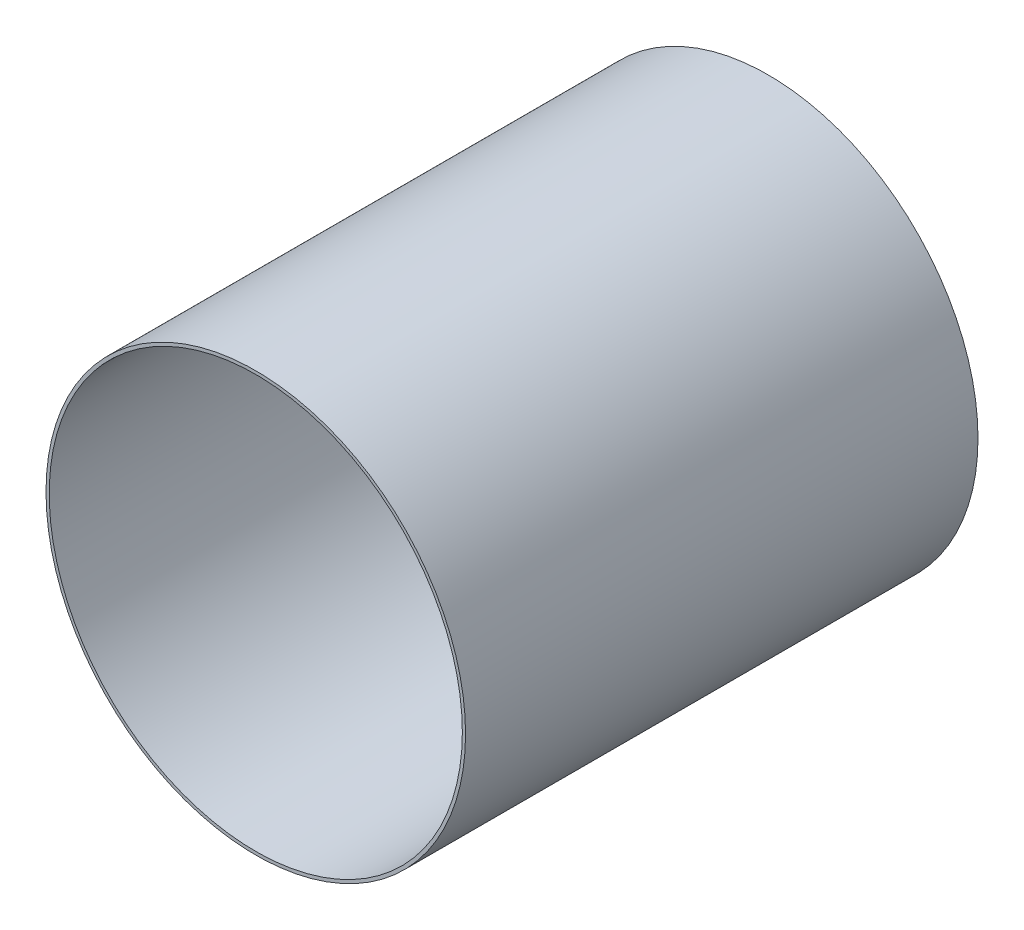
ISO-10303-21;
HEADER;
FILE_DESCRIPTION(('STEP AP214'),'2;1');
FILE_NAME('part.step','',(''),(''),'','','');
FILE_SCHEMA(('AUTOMOTIVE_DESIGN { 1 0 10303 214 1 1 1 1 }'));
ENDSEC;
DATA;
#1=APPLICATION_CONTEXT('core data for automotive mechanical design processes');
#2=APPLICATION_PROTOCOL_DEFINITION('international standard','automotive_design',2000,#1);
#3=PRODUCT_CONTEXT('',#1,'mechanical');
#4=PRODUCT('Part','Part','',(#3));
#5=PRODUCT_RELATED_PRODUCT_CATEGORY('part','',(#4));
#6=PRODUCT_DEFINITION_FORMATION('','',#4);
#7=PRODUCT_DEFINITION_CONTEXT('part definition',#1,'design');
#8=PRODUCT_DEFINITION('design','',#6,#7);
#9=PRODUCT_DEFINITION_SHAPE('','',#8);
#10=(LENGTH_UNIT() NAMED_UNIT(*) SI_UNIT(.MILLI.,.METRE.));
#11=(NAMED_UNIT(*) PLANE_ANGLE_UNIT() SI_UNIT($,.RADIAN.));
#12=(NAMED_UNIT(*) SI_UNIT($,.STERADIAN.) SOLID_ANGLE_UNIT());
#13=UNCERTAINTY_MEASURE_WITH_UNIT(LENGTH_MEASURE(1.E-05),#10,'distance_accuracy_value','');
#14=(GEOMETRIC_REPRESENTATION_CONTEXT(3) GLOBAL_UNCERTAINTY_ASSIGNED_CONTEXT((#13)) GLOBAL_UNIT_ASSIGNED_CONTEXT((#10,
#11,#12)) REPRESENTATION_CONTEXT('',''));
#15=CARTESIAN_POINT('',(0.,0.,0.));
#16=DIRECTION('',(0.,0.,1.));
#17=DIRECTION('',(1.,0.,0.));
#18=AXIS2_PLACEMENT_3D('',#15,#16,#17);
#19=CARTESIAN_POINT('',(0.,0.,31.));
#20=DIRECTION('',(0.,0.,1.));
#21=DIRECTION('',(1.,0.,0.));
#22=AXIS2_PLACEMENT_3D('',#19,#20,#21);
#23=PLANE('',#22);
#24=CARTESIAN_POINT('',(0.,0.,31.));
#25=DIRECTION('',(0.,0.,1.));
#26=DIRECTION('',(1.,0.,0.));
#27=AXIS2_PLACEMENT_3D('',#24,#25,#26);
#28=CIRCLE('',#27,13.1);
#29=CARTESIAN_POINT('',(13.1,0.,31.));
#30=VERTEX_POINT('',#29);
#31=EDGE_CURVE('E10',#30,#30,#28,.T.);
#32=ORIENTED_EDGE('',*,*,#31,.T.);
#33=EDGE_LOOP('',(#32));
#34=FACE_BOUND('',#33,.T.);
#35=CARTESIAN_POINT('',(0.,0.,31.));
#36=DIRECTION('',(0.,0.,1.));
#37=DIRECTION('',(1.,0.,0.));
#38=AXIS2_PLACEMENT_3D('',#35,#36,#37);
#39=CIRCLE('',#38,12.9);
#40=CARTESIAN_POINT('',(12.9,0.,31.));
#41=VERTEX_POINT('',#40);
#42=EDGE_CURVE('E38',#41,#41,#39,.T.);
#43=ORIENTED_EDGE('',*,*,#42,.F.);
#44=EDGE_LOOP('',(#43));
#45=FACE_BOUND('',#44,.T.);
#46=ADVANCED_FACE('F31',(#34,#45),#23,.T.);
#47=CARTESIAN_POINT('',(0.,0.,31.));
#48=DIRECTION('',(0.,0.,-1.));
#49=DIRECTION('',(-1.,0.,0.));
#50=AXIS2_PLACEMENT_3D('',#47,#48,#49);
#51=CYLINDRICAL_SURFACE('',#50,13.1);
#52=ORIENTED_EDGE('',*,*,#31,.F.);
#53=EDGE_LOOP('',(#52));
#54=FACE_BOUND('',#53,.T.);
#55=CARTESIAN_POINT('',(0.,0.,-1.));
#56=DIRECTION('',(0.,0.,-1.));
#57=DIRECTION('',(-1.,0.,0.));
#58=AXIS2_PLACEMENT_3D('',#55,#56,#57);
#59=CIRCLE('',#58,13.1);
#60=CARTESIAN_POINT('',(-13.1,0.,-1.));
#61=VERTEX_POINT('',#60);
#62=EDGE_CURVE('E47',#61,#61,#59,.T.);
#63=ORIENTED_EDGE('',*,*,#62,.F.);
#64=EDGE_LOOP('',(#63));
#65=FACE_BOUND('',#64,.T.);
#66=ADVANCED_FACE('F33',(#54,#65),#51,.T.);
#67=CARTESIAN_POINT('',(0.,0.,31.));
#68=DIRECTION('',(0.,0.,-1.));
#69=DIRECTION('',(-1.,0.,0.));
#70=AXIS2_PLACEMENT_3D('',#67,#68,#69);
#71=CYLINDRICAL_SURFACE('',#70,12.9);
#72=ORIENTED_EDGE('',*,*,#42,.T.);
#73=EDGE_LOOP('',(#72));
#74=FACE_BOUND('',#73,.T.);
#75=CARTESIAN_POINT('',(0.,0.,0.));
#76=DIRECTION('',(0.,0.,1.));
#77=DIRECTION('',(1.,0.,0.));
#78=AXIS2_PLACEMENT_3D('',#75,#76,#77);
#79=CIRCLE('',#78,12.9);
#80=CARTESIAN_POINT('',(12.9,0.,0.));
#81=VERTEX_POINT('',#80);
#82=EDGE_CURVE('E42',#81,#81,#79,.T.);
#83=ORIENTED_EDGE('',*,*,#82,.F.);
#84=EDGE_LOOP('',(#83));
#85=FACE_BOUND('',#84,.T.);
#86=ADVANCED_FACE('F55',(#74,#85),#71,.F.);
#87=CARTESIAN_POINT('',(0.,0.,0.));
#88=DIRECTION('',(0.,0.,-1.));
#89=DIRECTION('',(-1.,0.,0.));
#90=AXIS2_PLACEMENT_3D('',#87,#88,#89);
#91=PLANE('',#90);
#92=ORIENTED_EDGE('',*,*,#82,.T.);
#93=EDGE_LOOP('',(#92));
#94=FACE_BOUND('',#93,.T.);
#95=ADVANCED_FACE('F61',(#94),#91,.F.);
#96=CARTESIAN_POINT('',(0.,0.,-1.));
#97=DIRECTION('',(0.,0.,-1.));
#98=DIRECTION('',(-1.,0.,0.));
#99=AXIS2_PLACEMENT_3D('',#96,#97,#98);
#100=PLANE('',#99);
#101=ORIENTED_EDGE('',*,*,#62,.T.);
#102=EDGE_LOOP('',(#101));
#103=FACE_BOUND('',#102,.T.);
#104=ADVANCED_FACE('F52',(#103),#100,.T.);
#105=CLOSED_SHELL('',(#46,#66,#86,#95,#104));
#106=MANIFOLD_SOLID_BREP('B2',#105);
#107=ADVANCED_BREP_SHAPE_REPRESENTATION('',(#18,#106),#14);
#108=SHAPE_DEFINITION_REPRESENTATION(#9,#107);
ENDSEC;
END-ISO-10303-21;
